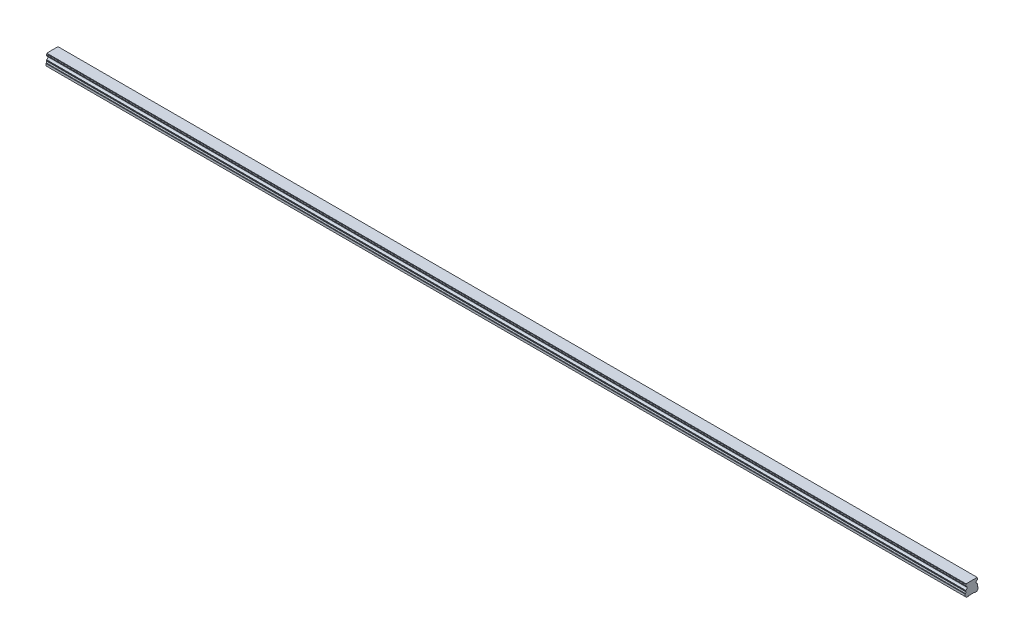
from build123d import *

# Parameters (mm, degrees)
BOSS_EXTRUDE1_DEPTH        = 1080
SKETCH3_R                  = 2.5
SKETCH3_R_2                = 2.1
CUT_EXTRUDE3_DEPTH         = 7
SKETCH3_2_R                = 2.1
CUT_EXTRUDE4_DEPTH         = 9.5
CHAMFER1_SIZE              = 0.4
LPATTERN2_COUNT            = 18
LPATTERN2_PITCH            = 60
CHAMFER1_OF_LPATTERN2_SIZE = 0.4


with BuildPart() as part:
    # Sketch1 → Boss-Extrude1 (new body)
    with BuildSketch(Plane(origin=(0, 0, 0), x_dir=(0, 0, -1), z_dir=(1, 0, 0))):
        with BuildLine():
            Line((6.59, 14), (-6.59, 14))
            Line((-6.59, 14), (-6.59, 13.15))
            Line((-6.59, 13.15), (-6.96, 12.356532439))
            Line((-6.96, 12.356532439), (-6.96, 11.435174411))
            ThreePointArc((-6.96, 11.435174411), (-5.25, 9.5), (-6.96, 7.564825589))
            Line((-6.96, 7.564825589), (-6.96, 6.643467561))
            Line((-6.96, 6.643467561), (-6.59, 5.85))
            Line((-6.59, 5.85), (-7.032116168, 4.2))
            Line((-7.032116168, 4.2), (-7.5, 3.929867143))
            Line((-7.5, 3.929867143), (-7.5, 1.4))
            Line((-7.5, 1.4), (-6.1, 0))
            Line((-6.1, 0), (-3.65, 0))
            Line((-3.65, 0), (-3.25, 0.4))
            Line((-3.25, 0.4), (3.25, 0.4))
            Line((3.25, 0.4), (3.65, 0))
            Line((3.65, 0), (6.1, 0))
            Line((6.1, 0), (7.5, 1.4))
            Line((7.5, 1.4), (7.5, 3.929867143))
            Line((7.5, 3.929867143), (7.032116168, 4.2))
            Line((7.032116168, 4.2), (6.59, 5.85))
            Line((6.59, 5.85), (6.96, 6.643467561))
            Line((6.96, 6.643467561), (6.96, 7.564825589))
            ThreePointArc((6.96, 7.564825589), (5.25, 9.5), (6.96, 11.435174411))
            Line((6.96, 11.435174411), (6.96, 12.356532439))
            Line((6.96, 12.356532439), (6.59, 13.15))
            Line((6.59, 13.15), (6.59, 14))
        make_face()
    extrude(amount=BOSS_EXTRUDE1_DEPTH)

    # Sketch3 → Cut-Extrude3 (cut)
    with BuildSketch(Plane.XZ):
        with Locations(Location((30, 0, 0), (0, 0, 270))):
            Circle(SKETCH3_R)
        with Locations(Location((30, 0, 0), (0, 0, 270))):
            Circle(SKETCH3_R_2, mode=Mode.SUBTRACT)
    cut_extrude3 = extrude(amount=-CUT_EXTRUDE3_DEPTH, mode=Mode.SUBTRACT)

    # Sketch3_2 → Cut-Extrude4 (cut)
    with BuildSketch(Plane.XZ):
        with Locations(Location((30, 0, 0), (0, 0, 270))):
            Circle(SKETCH3_2_R)
    cut_extrude4 = extrude(amount=-CUT_EXTRUDE4_DEPTH, mode=Mode.SUBTRACT)

    # Cut-Extrude5 cone 1 section (on through the dimple's axis) → Cut-Extrude5 (revolve, cut)
    with BuildSketch(Plane(origin=(30, 9.5, 0), x_dir=(0, 0, -1), z_dir=(1, 0, 0))):
        Polygon((0, 0), (2.1, 0), (0, 1.212435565), align=None)
    revolve(axis=Axis((30, 9.5, 0), (0, 1, 0)), mode=Mode.SUBTRACT)

    # Chamfer1
    chamfer1_edges = [part.edges().sort_by_distance(p)[0] for p in [
        (30, 0.4, 2.5),
    ]]
    chamfer(chamfer1_edges, length=CHAMFER1_SIZE)

    # LPattern2: Cut-Extrude3, Cut-Extrude4 ×18
    with Locations(*[(i * LPATTERN2_PITCH, 0, 0) for i in range(1, LPATTERN2_COUNT)]):
        add(cut_extrude3, mode=Mode.SUBTRACT)
        add(cut_extrude4, mode=Mode.SUBTRACT)

    # Chamfer1 of LPattern2
    chamfer1_of_lpattern2_edges = [part.edges().sort_by_distance(p)[0] for p in [
        (90, 0.4, 2.5),
        (150, 0.4, 2.5),
        (210, 0.4, 2.5),
        (270, 0.4, 2.5),
        (330, 0.4, 2.5),
        (390, 0.4, 2.5),
        (450, 0.4, 2.5),
        (510, 0.4, 2.5),
        (570, 0.4, 2.5),
        (630, 0.4, 2.5),
        (690, 0.4, 2.5),
        (750, 0.4, 2.5),
        (810, 0.4, 2.5),
        (870, 0.4, 2.5),
        (930, 0.4, 2.5),
        (990, 0.4, 2.5),
        (1050, 0.4, 2.5),
    ]]
    chamfer(chamfer1_of_lpattern2_edges, length=CHAMFER1_OF_LPATTERN2_SIZE)


solid = part.part
